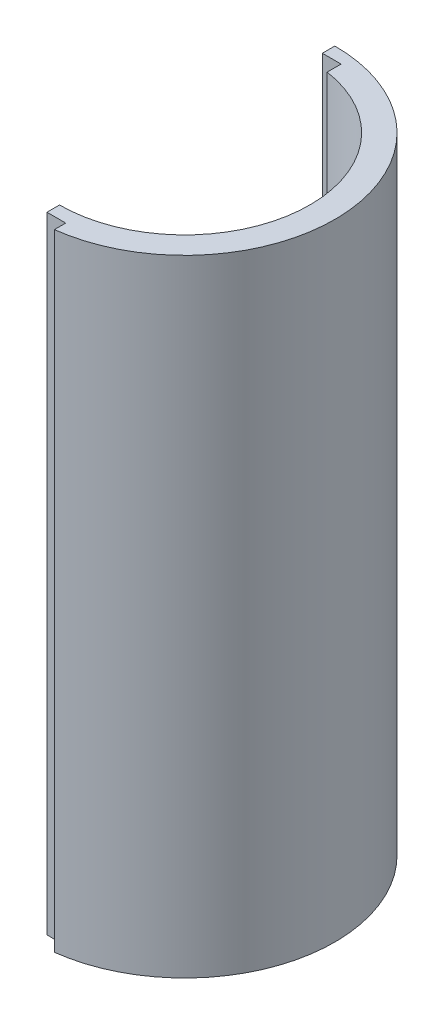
ISO-10303-21;
HEADER;
FILE_DESCRIPTION(('STEP AP214'),'2;1');
FILE_NAME('part.step','',(''),(''),'','','');
FILE_SCHEMA(('AUTOMOTIVE_DESIGN { 1 0 10303 214 1 1 1 1 }'));
ENDSEC;
DATA;
#1=APPLICATION_CONTEXT('core data for automotive mechanical design processes');
#2=APPLICATION_PROTOCOL_DEFINITION('international standard','automotive_design',2000,#1);
#3=PRODUCT_CONTEXT('',#1,'mechanical');
#4=PRODUCT('Part','Part','',(#3));
#5=PRODUCT_RELATED_PRODUCT_CATEGORY('part','',(#4));
#6=PRODUCT_DEFINITION_FORMATION('','',#4);
#7=PRODUCT_DEFINITION_CONTEXT('part definition',#1,'design');
#8=PRODUCT_DEFINITION('design','',#6,#7);
#9=PRODUCT_DEFINITION_SHAPE('','',#8);
#10=(LENGTH_UNIT() NAMED_UNIT(*) SI_UNIT(.MILLI.,.METRE.));
#11=(NAMED_UNIT(*) PLANE_ANGLE_UNIT() SI_UNIT($,.RADIAN.));
#12=(NAMED_UNIT(*) SI_UNIT($,.STERADIAN.) SOLID_ANGLE_UNIT());
#13=UNCERTAINTY_MEASURE_WITH_UNIT(LENGTH_MEASURE(1.E-05),#10,'distance_accuracy_value','');
#14=(GEOMETRIC_REPRESENTATION_CONTEXT(3) GLOBAL_UNCERTAINTY_ASSIGNED_CONTEXT((#13)) GLOBAL_UNIT_ASSIGNED_CONTEXT((#10,
#11,#12)) REPRESENTATION_CONTEXT('',''));
#15=CARTESIAN_POINT('',(0.,0.,0.));
#16=DIRECTION('',(0.,0.,1.));
#17=DIRECTION('',(1.,0.,0.));
#18=AXIS2_PLACEMENT_3D('',#15,#16,#17);
#19=CARTESIAN_POINT('',(0.,50.,0.));
#20=DIRECTION('',(0.,-1.,0.));
#21=DIRECTION('',(0.,0.,-1.));
#22=AXIS2_PLACEMENT_3D('',#19,#20,#21);
#23=CYLINDRICAL_SURFACE('',#22,10.);
#24=DIRECTION('',(0.,-1.,0.));
#25=VECTOR('',#24,1.);
#26=CARTESIAN_POINT('',(1.49947506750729,50.,-9.88693959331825));
#27=LINE('',#26,#25);
#28=CARTESIAN_POINT('',(1.49947506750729,0.,-9.88693959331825));
#29=VERTEX_POINT('',#28);
#30=CARTESIAN_POINT('',(1.49947506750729,50.,-9.88693959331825));
#31=VERTEX_POINT('',#30);
#32=EDGE_CURVE('E122',#29,#31,#27,.F.);
#33=ORIENTED_EDGE('',*,*,#32,.F.);
#34=CARTESIAN_POINT('',(0.,0.,0.));
#35=DIRECTION('',(0.,-1.,0.));
#36=DIRECTION('',(0.,0.,-1.));
#37=AXIS2_PLACEMENT_3D('',#34,#35,#36);
#38=CIRCLE('',#37,10.);
#39=CARTESIAN_POINT('',(0.,0.,10.));
#40=VERTEX_POINT('',#39);
#41=EDGE_CURVE('E116',#29,#40,#38,.T.);
#42=ORIENTED_EDGE('',*,*,#41,.T.);
#43=DIRECTION('',(0.,-1.,0.));
#44=VECTOR('',#43,1.);
#45=CARTESIAN_POINT('',(0.,50.,10.));
#46=LINE('',#45,#44);
#47=CARTESIAN_POINT('',(0.,50.,10.));
#48=VERTEX_POINT('',#47);
#49=EDGE_CURVE('E138',#48,#40,#46,.T.);
#50=ORIENTED_EDGE('',*,*,#49,.F.);
#51=CARTESIAN_POINT('',(0.,50.,0.));
#52=DIRECTION('',(0.,-1.,0.));
#53=DIRECTION('',(0.,0.,-1.));
#54=AXIS2_PLACEMENT_3D('',#51,#52,#53);
#55=CIRCLE('',#54,10.);
#56=EDGE_CURVE('E134',#31,#48,#55,.T.);
#57=ORIENTED_EDGE('',*,*,#56,.F.);
#58=EDGE_LOOP('',(#33,#42,#50,#57));
#59=FACE_BOUND('',#58,.T.);
#60=ADVANCED_FACE('F33',(#59),#23,.F.);
#61=CARTESIAN_POINT('',(0.,50.,10.));
#62=DIRECTION('',(1.,0.,0.));
#63=DIRECTION('',(0.,0.,-1.));
#64=AXIS2_PLACEMENT_3D('',#61,#62,#63);
#65=PLANE('',#64);
#66=DIRECTION('',(0.,-1.,0.));
#67=VECTOR('',#66,1.);
#68=CARTESIAN_POINT('',(0.,60.,11.));
#69=LINE('',#68,#67);
#70=CARTESIAN_POINT('',(0.,50.,11.));
#71=VERTEX_POINT('',#70);
#72=CARTESIAN_POINT('',(0.,0.,11.));
#73=VERTEX_POINT('',#72);
#74=EDGE_CURVE('E47',#71,#73,#69,.T.);
#75=ORIENTED_EDGE('',*,*,#74,.F.);
#76=DIRECTION('',(0.,0.,1.));
#77=VECTOR('',#76,1.);
#78=CARTESIAN_POINT('',(0.,50.,10.));
#79=LINE('',#78,#77);
#80=EDGE_CURVE('E162',#48,#71,#79,.T.);
#81=ORIENTED_EDGE('',*,*,#80,.F.);
#82=ORIENTED_EDGE('',*,*,#49,.T.);
#83=DIRECTION('',(0.,0.,1.));
#84=VECTOR('',#83,1.);
#85=CARTESIAN_POINT('',(0.,0.,10.));
#86=LINE('',#85,#84);
#87=EDGE_CURVE('E118',#40,#73,#86,.T.);
#88=ORIENTED_EDGE('',*,*,#87,.T.);
#89=EDGE_LOOP('',(#75,#81,#82,#88));
#90=FACE_BOUND('',#89,.T.);
#91=ADVANCED_FACE('F178',(#90),#65,.F.);
#92=CARTESIAN_POINT('',(0.,50.,0.));
#93=DIRECTION('',(0.,-1.,0.));
#94=DIRECTION('',(0.,0.,-1.));
#95=AXIS2_PLACEMENT_3D('',#92,#93,#94);
#96=CYLINDRICAL_SURFACE('',#95,12.);
#97=DIRECTION('',(0.,-1.,0.));
#98=VECTOR('',#97,1.);
#99=CARTESIAN_POINT('',(1.49947506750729,50.,11.9059470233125));
#100=LINE('',#99,#98);
#101=CARTESIAN_POINT('',(1.49947506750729,0.,11.9059470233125));
#102=VERTEX_POINT('',#101);
#103=CARTESIAN_POINT('',(1.49947506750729,50.,11.9059470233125));
#104=VERTEX_POINT('',#103);
#105=EDGE_CURVE('E145',#102,#104,#100,.F.);
#106=ORIENTED_EDGE('',*,*,#105,.F.);
#107=CARTESIAN_POINT('',(0.,0.,0.));
#108=DIRECTION('',(0.,1.,0.));
#109=DIRECTION('',(0.,0.,1.));
#110=AXIS2_PLACEMENT_3D('',#107,#108,#109);
#111=CIRCLE('',#110,12.);
#112=CARTESIAN_POINT('',(0.,0.,-12.));
#113=VERTEX_POINT('',#112);
#114=EDGE_CURVE('E124',#102,#113,#111,.T.);
#115=ORIENTED_EDGE('',*,*,#114,.T.);
#116=DIRECTION('',(0.,-1.,0.));
#117=VECTOR('',#116,1.);
#118=CARTESIAN_POINT('',(0.,50.,-12.));
#119=LINE('',#118,#117);
#120=CARTESIAN_POINT('',(0.,50.,-12.));
#121=VERTEX_POINT('',#120);
#122=EDGE_CURVE('E135',#121,#113,#119,.T.);
#123=ORIENTED_EDGE('',*,*,#122,.F.);
#124=CARTESIAN_POINT('',(0.,50.,0.));
#125=DIRECTION('',(0.,1.,0.));
#126=DIRECTION('',(0.,0.,1.));
#127=AXIS2_PLACEMENT_3D('',#124,#125,#126);
#128=CIRCLE('',#127,12.);
#129=EDGE_CURVE('E152',#104,#121,#128,.T.);
#130=ORIENTED_EDGE('',*,*,#129,.F.);
#131=EDGE_LOOP('',(#106,#115,#123,#130));
#132=FACE_BOUND('',#131,.T.);
#133=ADVANCED_FACE('F150',(#132),#96,.T.);
#134=CARTESIAN_POINT('',(0.,50.,-10.));
#135=DIRECTION('',(1.,0.,0.));
#136=DIRECTION('',(0.,0.,-1.));
#137=AXIS2_PLACEMENT_3D('',#134,#135,#136);
#138=PLANE('',#137);
#139=DIRECTION('',(0.,-1.,0.));
#140=VECTOR('',#139,1.);
#141=CARTESIAN_POINT('',(0.,60.,-11.));
#142=LINE('',#141,#140);
#143=CARTESIAN_POINT('',(0.,50.,-11.));
#144=VERTEX_POINT('',#143);
#145=CARTESIAN_POINT('',(0.,0.,-11.));
#146=VERTEX_POINT('',#145);
#147=EDGE_CURVE('E55',#144,#146,#142,.T.);
#148=ORIENTED_EDGE('',*,*,#147,.F.);
#149=DIRECTION('',(0.,0.,1.));
#150=VECTOR('',#149,1.);
#151=CARTESIAN_POINT('',(0.,50.,-10.));
#152=LINE('',#151,#150);
#153=EDGE_CURVE('E128',#121,#144,#152,.T.);
#154=ORIENTED_EDGE('',*,*,#153,.F.);
#155=ORIENTED_EDGE('',*,*,#122,.T.);
#156=DIRECTION('',(0.,0.,1.));
#157=VECTOR('',#156,1.);
#158=CARTESIAN_POINT('',(0.,0.,-10.));
#159=LINE('',#158,#157);
#160=EDGE_CURVE('E132',#113,#146,#159,.T.);
#161=ORIENTED_EDGE('',*,*,#160,.T.);
#162=EDGE_LOOP('',(#148,#154,#155,#161));
#163=FACE_BOUND('',#162,.T.);
#164=ADVANCED_FACE('F169',(#163),#138,.F.);
#165=CARTESIAN_POINT('',(0.,50.,0.));
#166=DIRECTION('',(0.,-1.,0.));
#167=DIRECTION('',(0.,0.,-1.));
#168=AXIS2_PLACEMENT_3D('',#165,#166,#167);
#169=PLANE('',#168);
#170=DIRECTION('',(0.,0.,-1.));
#171=VECTOR('',#170,1.);
#172=CARTESIAN_POINT('',(1.49947506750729,50.,0.));
#173=LINE('',#172,#171);
#174=CARTESIAN_POINT('',(1.49947506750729,50.,-11.));
#175=VERTEX_POINT('',#174);
#176=EDGE_CURVE('E102',#31,#175,#173,.T.);
#177=ORIENTED_EDGE('',*,*,#176,.F.);
#178=ORIENTED_EDGE('',*,*,#56,.T.);
#179=ORIENTED_EDGE('',*,*,#80,.T.);
#180=DIRECTION('',(-1.,0.,0.));
#181=VECTOR('',#180,1.);
#182=CARTESIAN_POINT('',(0.,50.,11.));
#183=LINE('',#182,#181);
#184=CARTESIAN_POINT('',(1.49947506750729,50.,11.));
#185=VERTEX_POINT('',#184);
#186=EDGE_CURVE('E104',#185,#71,#183,.T.);
#187=ORIENTED_EDGE('',*,*,#186,.F.);
#188=DIRECTION('',(0.,0.,-1.));
#189=VECTOR('',#188,1.);
#190=CARTESIAN_POINT('',(1.49947506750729,50.,0.));
#191=LINE('',#190,#189);
#192=EDGE_CURVE('E154',#104,#185,#191,.T.);
#193=ORIENTED_EDGE('',*,*,#192,.F.);
#194=ORIENTED_EDGE('',*,*,#129,.T.);
#195=ORIENTED_EDGE('',*,*,#153,.T.);
#196=DIRECTION('',(-1.,0.,0.));
#197=VECTOR('',#196,1.);
#198=CARTESIAN_POINT('',(0.,50.,-11.));
#199=LINE('',#198,#197);
#200=EDGE_CURVE('E153',#175,#144,#199,.T.);
#201=ORIENTED_EDGE('',*,*,#200,.F.);
#202=EDGE_LOOP('',(#177,#178,#179,#187,#193,#194,#195,#201));
#203=FACE_BOUND('',#202,.T.);
#204=ADVANCED_FACE('F167',(#203),#169,.F.);
#205=CARTESIAN_POINT('',(0.,0.,0.));
#206=DIRECTION('',(0.,-1.,0.));
#207=DIRECTION('',(0.,0.,-1.));
#208=AXIS2_PLACEMENT_3D('',#205,#206,#207);
#209=PLANE('',#208);
#210=ORIENTED_EDGE('',*,*,#41,.F.);
#211=DIRECTION('',(0.,0.,-1.));
#212=VECTOR('',#211,1.);
#213=CARTESIAN_POINT('',(1.49947506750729,0.,0.));
#214=LINE('',#213,#212);
#215=CARTESIAN_POINT('',(1.49947506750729,0.,-11.));
#216=VERTEX_POINT('',#215);
#217=EDGE_CURVE('E11',#29,#216,#214,.T.);
#218=ORIENTED_EDGE('',*,*,#217,.T.);
#219=DIRECTION('',(-1.,0.,0.));
#220=VECTOR('',#219,1.);
#221=CARTESIAN_POINT('',(0.,0.,-11.));
#222=LINE('',#221,#220);
#223=EDGE_CURVE('E106',#216,#146,#222,.T.);
#224=ORIENTED_EDGE('',*,*,#223,.T.);
#225=ORIENTED_EDGE('',*,*,#160,.F.);
#226=ORIENTED_EDGE('',*,*,#114,.F.);
#227=DIRECTION('',(0.,0.,-1.));
#228=VECTOR('',#227,1.);
#229=CARTESIAN_POINT('',(1.49947506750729,0.,0.));
#230=LINE('',#229,#228);
#231=CARTESIAN_POINT('',(1.49947506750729,0.,11.));
#232=VERTEX_POINT('',#231);
#233=EDGE_CURVE('E40',#102,#232,#230,.T.);
#234=ORIENTED_EDGE('',*,*,#233,.T.);
#235=DIRECTION('',(-1.,0.,0.));
#236=VECTOR('',#235,1.);
#237=CARTESIAN_POINT('',(0.,0.,11.));
#238=LINE('',#237,#236);
#239=EDGE_CURVE('E141',#232,#73,#238,.T.);
#240=ORIENTED_EDGE('',*,*,#239,.T.);
#241=ORIENTED_EDGE('',*,*,#87,.F.);
#242=EDGE_LOOP('',(#210,#218,#224,#225,#226,#234,#240,#241));
#243=FACE_BOUND('',#242,.T.);
#244=ADVANCED_FACE('F114',(#243),#209,.T.);
#245=CARTESIAN_POINT('',(1.49947506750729,60.,11.));
#246=DIRECTION('',(-1.,0.,0.));
#247=DIRECTION('',(0.,0.,1.));
#248=AXIS2_PLACEMENT_3D('',#245,#246,#247);
#249=PLANE('',#248);
#250=ORIENTED_EDGE('',*,*,#105,.T.);
#251=ORIENTED_EDGE('',*,*,#192,.T.);
#252=DIRECTION('',(0.,-1.,0.));
#253=VECTOR('',#252,1.);
#254=CARTESIAN_POINT('',(1.49947506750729,60.,11.));
#255=LINE('',#254,#253);
#256=EDGE_CURVE('E111',#185,#232,#255,.T.);
#257=ORIENTED_EDGE('',*,*,#256,.T.);
#258=ORIENTED_EDGE('',*,*,#233,.F.);
#259=EDGE_LOOP('',(#250,#251,#257,#258));
#260=FACE_BOUND('',#259,.T.);
#261=ADVANCED_FACE('F144',(#260),#249,.T.);
#262=CARTESIAN_POINT('',(0.,60.,11.));
#263=DIRECTION('',(0.,0.,1.));
#264=DIRECTION('',(1.,0.,0.));
#265=AXIS2_PLACEMENT_3D('',#262,#263,#264);
#266=PLANE('',#265);
#267=ORIENTED_EDGE('',*,*,#186,.T.);
#268=ORIENTED_EDGE('',*,*,#74,.T.);
#269=ORIENTED_EDGE('',*,*,#239,.F.);
#270=ORIENTED_EDGE('',*,*,#256,.F.);
#271=EDGE_LOOP('',(#267,#268,#269,#270));
#272=FACE_BOUND('',#271,.T.);
#273=ADVANCED_FACE('F175',(#272),#266,.T.);
#274=CARTESIAN_POINT('',(1.49947506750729,60.,-11.));
#275=DIRECTION('',(-1.,0.,0.));
#276=DIRECTION('',(0.,0.,1.));
#277=AXIS2_PLACEMENT_3D('',#274,#275,#276);
#278=PLANE('',#277);
#279=ORIENTED_EDGE('',*,*,#32,.T.);
#280=ORIENTED_EDGE('',*,*,#176,.T.);
#281=DIRECTION('',(0.,-1.,0.));
#282=VECTOR('',#281,1.);
#283=CARTESIAN_POINT('',(1.49947506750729,60.,-11.));
#284=LINE('',#283,#282);
#285=EDGE_CURVE('E98',#175,#216,#284,.T.);
#286=ORIENTED_EDGE('',*,*,#285,.T.);
#287=ORIENTED_EDGE('',*,*,#217,.F.);
#288=EDGE_LOOP('',(#279,#280,#286,#287));
#289=FACE_BOUND('',#288,.T.);
#290=ADVANCED_FACE('F99',(#289),#278,.T.);
#291=CARTESIAN_POINT('',(0.,60.,-11.));
#292=DIRECTION('',(0.,0.,1.));
#293=DIRECTION('',(1.,0.,0.));
#294=AXIS2_PLACEMENT_3D('',#291,#292,#293);
#295=PLANE('',#294);
#296=ORIENTED_EDGE('',*,*,#200,.T.);
#297=ORIENTED_EDGE('',*,*,#147,.T.);
#298=ORIENTED_EDGE('',*,*,#223,.F.);
#299=ORIENTED_EDGE('',*,*,#285,.F.);
#300=EDGE_LOOP('',(#296,#297,#298,#299));
#301=FACE_BOUND('',#300,.T.);
#302=ADVANCED_FACE('F107',(#301),#295,.T.);
#303=CLOSED_SHELL('',(#60,#91,#133,#164,#204,#244,#261,#273,#290,#302));
#304=MANIFOLD_SOLID_BREP('B2',#303);
#305=ADVANCED_BREP_SHAPE_REPRESENTATION('',(#18,#304),#14);
#306=SHAPE_DEFINITION_REPRESENTATION(#9,#305);
ENDSEC;
END-ISO-10303-21;
